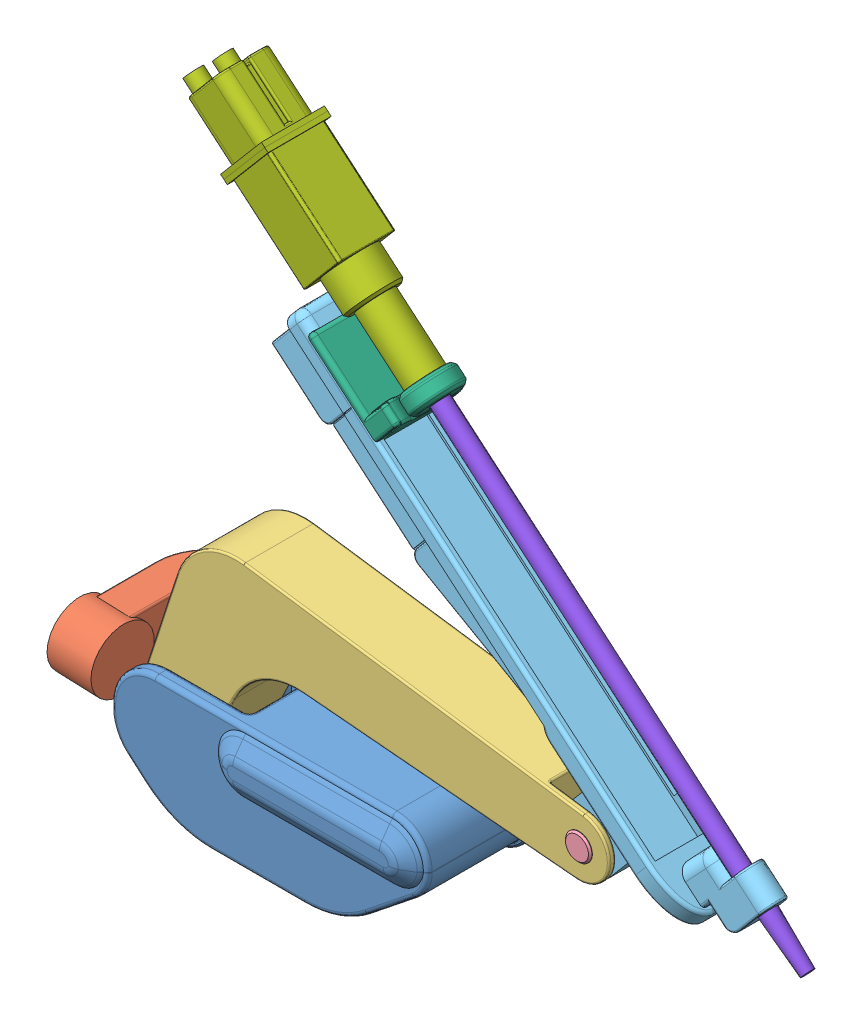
SolidWorks assembly Assembly 3.SLDASM, configuration Varsayılan (file format 10000). Lengths in mm.
Overall size (814.33 753.62 182.12).
8 component instances, 8 part files, 15 mates.
Components (placement in the parent):
- 19-1: 19.SLDPRT [Varsayılan] at (-2.307 -80.4709 -104.4246) size (365.79 145.79 142.85)
- 20-1: 20.SLDPRT [Varsayılan] at (94.8952 -13.0422 -105.4246) x (0.999236 -0.039071 0) z (0.039071 0.999236 0) size (428 178.6 72)
- 21-1: 21.SLDPRT [Varsayılan] at (162.007 131.936 -84.4246) x (0.996117 -0.088034 0) z (0 0 1) size (525.28 238.03 80)
- 24-2: 24.SLDPRT [Varsayılan] at (349.8049 112.8096 -86.9246) size (30 30 85)
- 28-1: 28.SLDPRT [Varsayılan] at (349.8049 112.8096 -76.9246) x (0.762571 -0.646905 0) z (0 0 1) size (615.04 173.14 85.1)
- 29-1: 29.SLDPRT [Varsayılan] at (330.9257 195.5005 -76.9246) x (0.762571 -0.646905 0) z (0.646905 0.762571 0) size (104.12 79.66 91.16)
- 30-1: 30.SLDPRT [Varsayılan] at (134.1468 445.9111 -45.2524) x (0 0 1) z (-0.646905 -0.762571 0) size (71.72 309 71.72)
- 31-1: 31.SLDPRT [Varsayılan] at (134.1468 445.9111 -45.2524) x (0.762571 -0.646905 0) z (0.475797 0.560869 0.677527) size (570 20 20)
Mates (geometry in assembly coordinates):
- Çakışık1: coincident aligned: axis of 19-1 through (157.693 19.5291 -105.4246) axis (0 0 -1); axis of 20-1 through (157.693 19.5291 -105.4246) axis (0 0 -1)
- Çakışık2: coincident anti-aligned: plane of 19-1 through (157.693 19.5291 -105.4246) normal (0 0 -1); plane of 20-1 through (157.693 19.5291 -105.4246) normal (0 0 1)
- Çakışık3: coincident aligned: axis of 19-1 through (-112.307 9.5291 -79.4246) axis (0 0 -1); axis of 21-1 through (-112.307 9.5291 -9.4246) axis (0 0 -1)
- Genişlik1: width aligned: plane of 21-1 through (162.007 131.936 -4.4246) normal (0 0 1); plane of 21-1 through (162.007 131.936 -84.4246) normal (0 0 -1); plane of 19-1 through (-2.307 -80.4709 -99.4246) normal (0 0 1); plane of 19-1 through (-2.307 -80.4709 10.5754) normal (0 0 -1)
- Genişlik3: width anti-aligned: plane of 24-2 through (349.8049 112.8096 -86.9246) normal (0 0 -1); plane of 24-2 through (349.8049 112.8096 -1.9246) normal (0 0 1); plane of 21-1 through (162.007 131.936 -4.4246) normal (0 0 1); plane of 21-1 through (162.007 131.936 -84.4246) normal (0 0 -1)
- Çakışık4: coincident aligned: axis of 24-2 through (349.8049 112.8096 -3.9246) axis (0 0 -1); axis of 28-1 through (349.8049 112.8096 -11.9246) axis (0 0 -1)
- Genişlik4: width anti-aligned: plane of 28-1 through (349.8049 112.8096 -11.9246) normal (0 0 1); plane of 28-1 through (349.8049 112.8096 -76.9246) normal (0 0 -1); plane of 21-1 through (162.007 131.936 -84.4246) normal (0 0 -1); plane of 21-1 through (162.007 131.936 -4.4246) normal (0 0 1)
- Çakışık5: coincident anti-aligned: axis of 21-1 through (349.8049 112.8096 -11.9246) axis (0 0 1); axis of 28-1 through (349.8049 112.8096 -11.9246) axis (0 0 -1)
- Çakışık6: coincident anti-aligned: plane of 28-1 through (17.4244 472.2695 -78.2552) normal (0 0 1); plane of 29-1 through (335.454 200.8385 -78.2552) normal (0 0 -1)
- Çakışık7: coincident anti-aligned: plane of 28-1 through (12.0872 465.9779 -73.9246) normal (0.646905 0.762571 0); plane of 29-1 through (330.9257 195.5005 -76.9246) normal (-0.646905 -0.762571 0)
- Çakışık8: coincident aligned: axis of 29-1 through (138.1447 442.5197 -45.2524) axis (0.762571 -0.646905 0); axis of 30-1 through (76.954 494.429 -45.2524) axis (0.762571 -0.646905 0)
- Paralel1: parallel anti-aligned: plane of 28-1 through (380.8564 149.413 -76.9246) normal (0.646905 0.762571 0); plane of 30-1 through (-53.118 562.1528 -77.7524) normal (-0.646905 -0.762571 0)
- Çakışık9: coincident anti-aligned: axis of 30-1 through (76.954 494.429 -45.2524) axis (0.762571 -0.646905 0); axis of 31-1 through (515.4322 122.4587 -45.2524) axis (-0.762571 0.646905 0)
- Çakışık10: coincident anti-aligned: plane of 30-1 through (134.1468 445.9111 -45.2524) normal (0.762571 -0.646905 0); plane of 31-1 through (134.1468 445.9111 -45.2524) normal (-0.762571 0.646905 0)
- Çakışık11: coincident anti-aligned: plane of 29-1 through (134.1468 445.9111 -45.2524) normal (-0.762571 0.646905 0); plane of 30-1 through (134.1468 445.9111 -45.2524) normal (0.762571 -0.646905 0)
